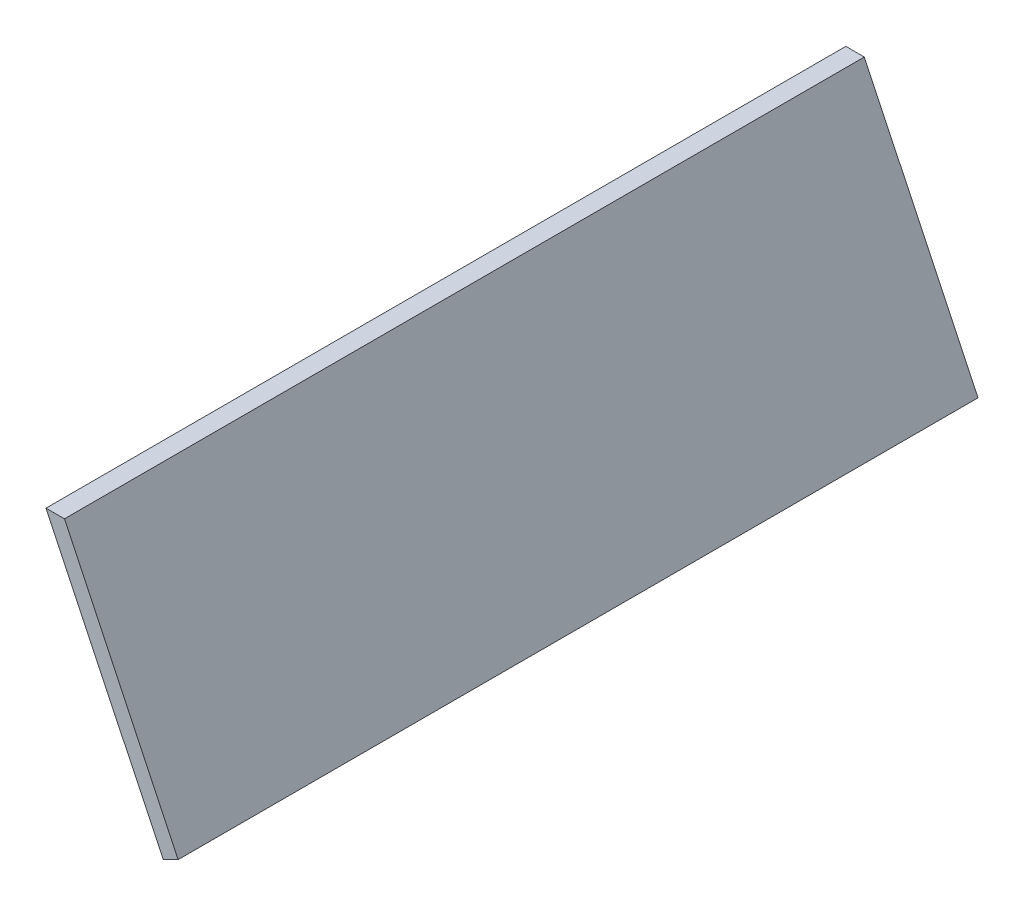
ISO-10303-21;
HEADER;
FILE_DESCRIPTION(('STEP AP214'),'2;1');
FILE_NAME('part.step','',(''),(''),'','','');
FILE_SCHEMA(('AUTOMOTIVE_DESIGN { 1 0 10303 214 1 1 1 1 }'));
ENDSEC;
DATA;
#1=APPLICATION_CONTEXT('core data for automotive mechanical design processes');
#2=APPLICATION_PROTOCOL_DEFINITION('international standard','automotive_design',2000,#1);
#3=PRODUCT_CONTEXT('',#1,'mechanical');
#4=PRODUCT('Part','Part','',(#3));
#5=PRODUCT_RELATED_PRODUCT_CATEGORY('part','',(#4));
#6=PRODUCT_DEFINITION_FORMATION('','',#4);
#7=PRODUCT_DEFINITION_CONTEXT('part definition',#1,'design');
#8=PRODUCT_DEFINITION('design','',#6,#7);
#9=PRODUCT_DEFINITION_SHAPE('','',#8);
#10=(LENGTH_UNIT() NAMED_UNIT(*) SI_UNIT(.MILLI.,.METRE.));
#11=(NAMED_UNIT(*) PLANE_ANGLE_UNIT() SI_UNIT($,.RADIAN.));
#12=(NAMED_UNIT(*) SI_UNIT($,.STERADIAN.) SOLID_ANGLE_UNIT());
#13=UNCERTAINTY_MEASURE_WITH_UNIT(LENGTH_MEASURE(1.E-05),#10,'distance_accuracy_value','');
#14=(GEOMETRIC_REPRESENTATION_CONTEXT(3) GLOBAL_UNCERTAINTY_ASSIGNED_CONTEXT((#13)) GLOBAL_UNIT_ASSIGNED_CONTEXT((#10,
#11,#12)) REPRESENTATION_CONTEXT('',''));
#15=CARTESIAN_POINT('',(0.,0.,0.));
#16=DIRECTION('',(0.,0.,1.));
#17=DIRECTION('',(1.,0.,0.));
#18=AXIS2_PLACEMENT_3D('',#15,#16,#17);
#19=CARTESIAN_POINT('',(-69.3413973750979,67.8391666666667,152.4));
#20=DIRECTION('',(0.,-1.,0.));
#21=DIRECTION('',(0.,0.,-1.));
#22=AXIS2_PLACEMENT_3D('',#19,#20,#21);
#23=PLANE('',#22);
#24=DIRECTION('',(-1.,0.,0.));
#25=VECTOR('',#24,1.);
#26=CARTESIAN_POINT('',(-69.3413973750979,67.8391666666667,0.));
#27=LINE('',#26,#25);
#28=CARTESIAN_POINT('',(-69.3413973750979,67.8391666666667,0.));
#29=VERTEX_POINT('',#28);
#30=CARTESIAN_POINT('',(-72.8590990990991,67.8391666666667,0.));
#31=VERTEX_POINT('',#30);
#32=EDGE_CURVE('E100',#29,#31,#27,.T.);
#33=ORIENTED_EDGE('',*,*,#32,.T.);
#34=DIRECTION('',(0.,0.,-1.));
#35=VECTOR('',#34,1.);
#36=CARTESIAN_POINT('',(-72.8590990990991,67.8391666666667,152.4));
#37=LINE('',#36,#35);
#38=CARTESIAN_POINT('',(-72.8590990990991,67.8391666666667,152.4));
#39=VERTEX_POINT('',#38);
#40=EDGE_CURVE('E11',#39,#31,#37,.T.);
#41=ORIENTED_EDGE('',*,*,#40,.F.);
#42=DIRECTION('',(-1.,0.,0.));
#43=VECTOR('',#42,1.);
#44=CARTESIAN_POINT('',(-69.3413973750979,67.8391666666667,152.4));
#45=LINE('',#44,#43);
#46=CARTESIAN_POINT('',(-69.3413973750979,67.8391666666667,152.4));
#47=VERTEX_POINT('',#46);
#48=EDGE_CURVE('E88',#47,#39,#45,.T.);
#49=ORIENTED_EDGE('',*,*,#48,.F.);
#50=DIRECTION('',(0.,0.,-1.));
#51=VECTOR('',#50,1.);
#52=CARTESIAN_POINT('',(-69.3413973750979,67.8391666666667,152.4));
#53=LINE('',#52,#51);
#54=EDGE_CURVE('E96',#47,#29,#53,.T.);
#55=ORIENTED_EDGE('',*,*,#54,.T.);
#56=EDGE_LOOP('',(#33,#41,#49,#55));
#57=FACE_BOUND('',#56,.T.);
#58=ADVANCED_FACE('F37',(#57),#23,.F.);
#59=CARTESIAN_POINT('',(-72.8590990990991,67.8391666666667,152.4));
#60=DIRECTION('',(0.902577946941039,0.430526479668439,0.));
#61=DIRECTION('',(-0.430526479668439,0.902577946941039,0.));
#62=AXIS2_PLACEMENT_3D('',#59,#60,#61);
#63=PLANE('',#62);
#64=DIRECTION('',(0.430526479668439,-0.902577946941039,0.));
#65=VECTOR('',#64,1.);
#66=CARTESIAN_POINT('',(-72.8590990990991,67.8391666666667,0.));
#67=LINE('',#66,#65);
#68=CARTESIAN_POINT('',(-50.546,21.0608333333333,0.));
#69=VERTEX_POINT('',#68);
#70=EDGE_CURVE('E92',#31,#69,#67,.T.);
#71=ORIENTED_EDGE('',*,*,#70,.T.);
#72=DIRECTION('',(0.,0.,-1.));
#73=VECTOR('',#72,1.);
#74=CARTESIAN_POINT('',(-50.546,21.0608333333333,152.4));
#75=LINE('',#74,#73);
#76=CARTESIAN_POINT('',(-50.546,21.0608333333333,152.4));
#77=VERTEX_POINT('',#76);
#78=EDGE_CURVE('E45',#77,#69,#75,.T.);
#79=ORIENTED_EDGE('',*,*,#78,.F.);
#80=DIRECTION('',(0.430526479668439,-0.902577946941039,0.));
#81=VECTOR('',#80,1.);
#82=CARTESIAN_POINT('',(-72.8590990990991,67.8391666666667,152.4));
#83=LINE('',#82,#81);
#84=EDGE_CURVE('E83',#39,#77,#83,.T.);
#85=ORIENTED_EDGE('',*,*,#84,.F.);
#86=ORIENTED_EDGE('',*,*,#40,.T.);
#87=EDGE_LOOP('',(#71,#79,#85,#86));
#88=FACE_BOUND('',#87,.T.);
#89=ADVANCED_FACE('F91',(#88),#63,.F.);
#90=CARTESIAN_POINT('',(-50.546,21.0608333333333,152.4));
#91=DIRECTION('',(-0.43052647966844,0.902577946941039,0.));
#92=DIRECTION('',(-0.902577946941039,-0.43052647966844,0.));
#93=AXIS2_PLACEMENT_3D('',#90,#91,#92);
#94=PLANE('',#93);
#95=DIRECTION('',(0.902577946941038,0.43052647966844,0.));
#96=VECTOR('',#95,1.);
#97=CARTESIAN_POINT('',(-50.546,21.0608333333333,0.));
#98=LINE('',#97,#96);
#99=CARTESIAN_POINT('',(-47.6803150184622,22.4277549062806,0.));
#100=VERTEX_POINT('',#99);
#101=EDGE_CURVE('E70',#69,#100,#98,.T.);
#102=ORIENTED_EDGE('',*,*,#101,.T.);
#103=DIRECTION('',(0.,0.,-1.));
#104=VECTOR('',#103,1.);
#105=CARTESIAN_POINT('',(-47.6803150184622,22.4277549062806,152.4));
#106=LINE('',#105,#104);
#107=CARTESIAN_POINT('',(-47.6803150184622,22.4277549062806,152.4));
#108=VERTEX_POINT('',#107);
#109=EDGE_CURVE('E93',#108,#100,#106,.T.);
#110=ORIENTED_EDGE('',*,*,#109,.F.);
#111=DIRECTION('',(0.902577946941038,0.43052647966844,0.));
#112=VECTOR('',#111,1.);
#113=CARTESIAN_POINT('',(-50.546,21.0608333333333,152.4));
#114=LINE('',#113,#112);
#115=EDGE_CURVE('E86',#77,#108,#114,.T.);
#116=ORIENTED_EDGE('',*,*,#115,.F.);
#117=ORIENTED_EDGE('',*,*,#78,.T.);
#118=EDGE_LOOP('',(#102,#110,#116,#117));
#119=FACE_BOUND('',#118,.T.);
#120=ADVANCED_FACE('F94',(#119),#94,.F.);
#121=CARTESIAN_POINT('',(-47.6803150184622,22.4277549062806,152.4));
#122=DIRECTION('',(-0.902577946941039,-0.43052647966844,0.));
#123=DIRECTION('',(0.43052647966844,-0.902577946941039,0.));
#124=AXIS2_PLACEMENT_3D('',#121,#122,#123);
#125=PLANE('',#124);
#126=DIRECTION('',(-0.43052647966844,0.902577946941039,0.));
#127=VECTOR('',#126,1.);
#128=CARTESIAN_POINT('',(-47.6803150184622,22.4277549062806,0.));
#129=LINE('',#128,#127);
#130=EDGE_CURVE('E76',#100,#29,#129,.T.);
#131=ORIENTED_EDGE('',*,*,#130,.T.);
#132=ORIENTED_EDGE('',*,*,#54,.F.);
#133=DIRECTION('',(-0.43052647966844,0.902577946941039,0.));
#134=VECTOR('',#133,1.);
#135=CARTESIAN_POINT('',(-47.6803150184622,22.4277549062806,152.4));
#136=LINE('',#135,#134);
#137=EDGE_CURVE('E53',#108,#47,#136,.T.);
#138=ORIENTED_EDGE('',*,*,#137,.F.);
#139=ORIENTED_EDGE('',*,*,#109,.T.);
#140=EDGE_LOOP('',(#131,#132,#138,#139));
#141=FACE_BOUND('',#140,.T.);
#142=ADVANCED_FACE('F107',(#141),#125,.F.);
#143=CARTESIAN_POINT('',(0.,0.,152.4));
#144=DIRECTION('',(0.,0.,1.));
#145=DIRECTION('',(1.,0.,0.));
#146=AXIS2_PLACEMENT_3D('',#143,#144,#145);
#147=PLANE('',#146);
#148=ORIENTED_EDGE('',*,*,#48,.T.);
#149=ORIENTED_EDGE('',*,*,#84,.T.);
#150=ORIENTED_EDGE('',*,*,#115,.T.);
#151=ORIENTED_EDGE('',*,*,#137,.T.);
#152=EDGE_LOOP('',(#148,#149,#150,#151));
#153=FACE_BOUND('',#152,.T.);
#154=ADVANCED_FACE('F84',(#153),#147,.T.);
#155=CARTESIAN_POINT('',(0.,0.,0.));
#156=DIRECTION('',(0.,0.,1.));
#157=DIRECTION('',(1.,0.,0.));
#158=AXIS2_PLACEMENT_3D('',#155,#156,#157);
#159=PLANE('',#158);
#160=ORIENTED_EDGE('',*,*,#32,.F.);
#161=ORIENTED_EDGE('',*,*,#130,.F.);
#162=ORIENTED_EDGE('',*,*,#101,.F.);
#163=ORIENTED_EDGE('',*,*,#70,.F.);
#164=EDGE_LOOP('',(#160,#161,#162,#163));
#165=FACE_BOUND('',#164,.T.);
#166=ADVANCED_FACE('F110',(#165),#159,.F.);
#167=CLOSED_SHELL('',(#58,#89,#120,#142,#154,#166));
#168=MANIFOLD_SOLID_BREP('B2',#167);
#169=ADVANCED_BREP_SHAPE_REPRESENTATION('',(#18,#168),#14);
#170=SHAPE_DEFINITION_REPRESENTATION(#9,#169);
ENDSEC;
END-ISO-10303-21;
